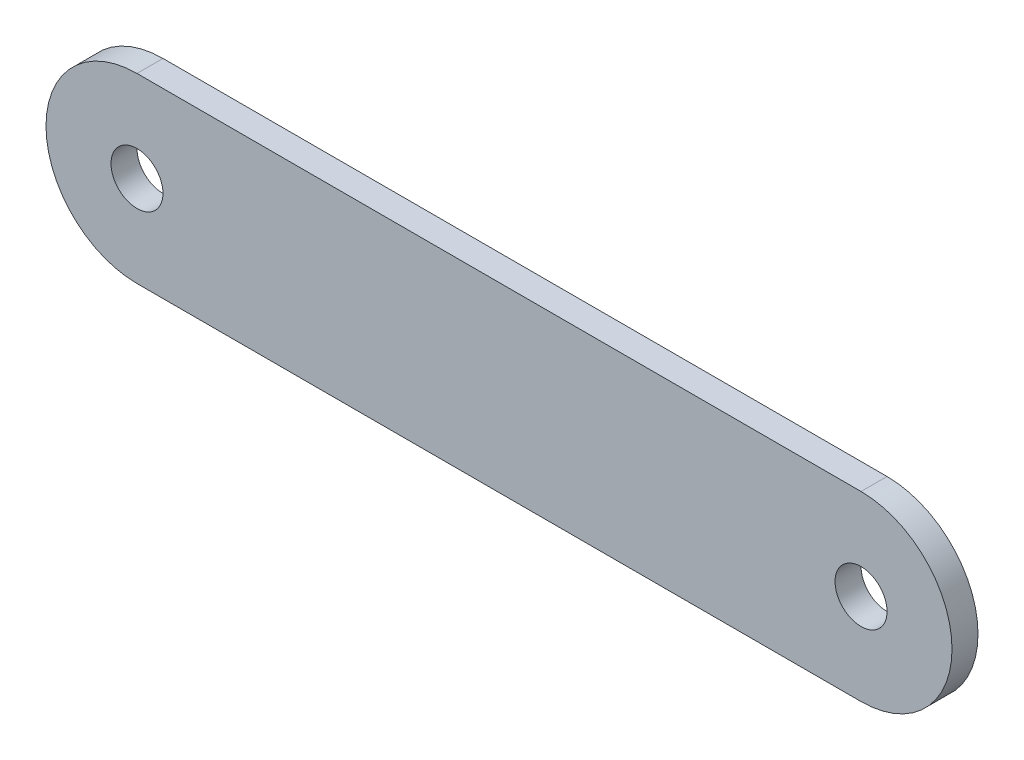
ISO-10303-21;
HEADER;
FILE_DESCRIPTION(('STEP AP214'),'2;1');
FILE_NAME('part.step','',(''),(''),'','','');
FILE_SCHEMA(('AUTOMOTIVE_DESIGN { 1 0 10303 214 1 1 1 1 }'));
ENDSEC;
DATA;
#1=APPLICATION_CONTEXT('core data for automotive mechanical design processes');
#2=APPLICATION_PROTOCOL_DEFINITION('international standard','automotive_design',2000,#1);
#3=PRODUCT_CONTEXT('',#1,'mechanical');
#4=PRODUCT('Part','Part','',(#3));
#5=PRODUCT_RELATED_PRODUCT_CATEGORY('part','',(#4));
#6=PRODUCT_DEFINITION_FORMATION('','',#4);
#7=PRODUCT_DEFINITION_CONTEXT('part definition',#1,'design');
#8=PRODUCT_DEFINITION('design','',#6,#7);
#9=PRODUCT_DEFINITION_SHAPE('','',#8);
#10=(LENGTH_UNIT() NAMED_UNIT(*) SI_UNIT(.MILLI.,.METRE.));
#11=(NAMED_UNIT(*) PLANE_ANGLE_UNIT() SI_UNIT($,.RADIAN.));
#12=(NAMED_UNIT(*) SI_UNIT($,.STERADIAN.) SOLID_ANGLE_UNIT());
#13=UNCERTAINTY_MEASURE_WITH_UNIT(LENGTH_MEASURE(1.E-05),#10,'distance_accuracy_value','');
#14=(GEOMETRIC_REPRESENTATION_CONTEXT(3) GLOBAL_UNCERTAINTY_ASSIGNED_CONTEXT((#13)) GLOBAL_UNIT_ASSIGNED_CONTEXT((#10,
#11,#12)) REPRESENTATION_CONTEXT('',''));
#15=CARTESIAN_POINT('',(0.,0.,0.));
#16=DIRECTION('',(0.,0.,1.));
#17=DIRECTION('',(1.,0.,0.));
#18=AXIS2_PLACEMENT_3D('',#15,#16,#17);
#19=CARTESIAN_POINT('',(0.,0.,50.8));
#20=DIRECTION('',(0.,0.,1.));
#21=DIRECTION('',(1.,0.,0.));
#22=AXIS2_PLACEMENT_3D('',#19,#20,#21);
#23=PLANE('',#22);
#24=CARTESIAN_POINT('',(0.,0.,50.8));
#25=DIRECTION('',(0.,0.,1.));
#26=DIRECTION('',(1.,0.,0.));
#27=AXIS2_PLACEMENT_3D('',#24,#25,#26);
#28=CIRCLE('',#27,50.8);
#29=CARTESIAN_POINT('',(50.8,0.,50.8));
#30=VERTEX_POINT('',#29);
#31=EDGE_CURVE('E99',#30,#30,#28,.T.);
#32=ORIENTED_EDGE('',*,*,#31,.F.);
#33=EDGE_LOOP('',(#32));
#34=FACE_BOUND('',#33,.T.);
#35=CARTESIAN_POINT('',(0.,0.,50.8));
#36=DIRECTION('',(0.,0.,1.));
#37=DIRECTION('',(1.,0.,0.));
#38=AXIS2_PLACEMENT_3D('',#35,#36,#37);
#39=CIRCLE('',#38,177.8);
#40=CARTESIAN_POINT('',(0.,177.8,50.8));
#41=VERTEX_POINT('',#40);
#42=CARTESIAN_POINT('',(0.,-177.8,50.8));
#43=VERTEX_POINT('',#42);
#44=EDGE_CURVE('E84',#41,#43,#39,.T.);
#45=ORIENTED_EDGE('',*,*,#44,.T.);
#46=DIRECTION('',(1.,0.,0.));
#47=VECTOR('',#46,1.);
#48=CARTESIAN_POINT('',(0.,-177.8,50.8));
#49=LINE('',#48,#47);
#50=CARTESIAN_POINT('',(1415.,-177.8,50.8));
#51=VERTEX_POINT('',#50);
#52=EDGE_CURVE('E79',#43,#51,#49,.T.);
#53=ORIENTED_EDGE('',*,*,#52,.T.);
#54=CARTESIAN_POINT('',(1415.,0.,50.8));
#55=DIRECTION('',(0.,0.,1.));
#56=DIRECTION('',(1.,0.,0.));
#57=AXIS2_PLACEMENT_3D('',#54,#55,#56);
#58=CIRCLE('',#57,177.8);
#59=CARTESIAN_POINT('',(1415.,177.8,50.8));
#60=VERTEX_POINT('',#59);
#61=EDGE_CURVE('E82',#51,#60,#58,.T.);
#62=ORIENTED_EDGE('',*,*,#61,.T.);
#63=DIRECTION('',(-1.,0.,0.));
#64=VECTOR('',#63,1.);
#65=CARTESIAN_POINT('',(0.,177.8,50.8));
#66=LINE('',#65,#64);
#67=EDGE_CURVE('E49',#60,#41,#66,.T.);
#68=ORIENTED_EDGE('',*,*,#67,.T.);
#69=EDGE_LOOP('',(#45,#53,#62,#68));
#70=FACE_BOUND('',#69,.T.);
#71=CARTESIAN_POINT('',(1415.,0.,50.8));
#72=DIRECTION('',(0.,0.,1.));
#73=DIRECTION('',(1.,0.,0.));
#74=AXIS2_PLACEMENT_3D('',#71,#72,#73);
#75=CIRCLE('',#74,50.8);
#76=CARTESIAN_POINT('',(1465.8,0.,50.8));
#77=VERTEX_POINT('',#76);
#78=EDGE_CURVE('E114',#77,#77,#75,.T.);
#79=ORIENTED_EDGE('',*,*,#78,.F.);
#80=EDGE_LOOP('',(#79));
#81=FACE_BOUND('',#80,.T.);
#82=ADVANCED_FACE('F32',(#34,#70,#81),#23,.T.);
#83=CARTESIAN_POINT('',(0.,0.,0.));
#84=DIRECTION('',(0.,0.,1.));
#85=DIRECTION('',(1.,0.,0.));
#86=AXIS2_PLACEMENT_3D('',#83,#84,#85);
#87=PLANE('',#86);
#88=CARTESIAN_POINT('',(0.,0.,0.));
#89=DIRECTION('',(0.,0.,1.));
#90=DIRECTION('',(1.,0.,0.));
#91=AXIS2_PLACEMENT_3D('',#88,#89,#90);
#92=CIRCLE('',#91,50.8);
#93=CARTESIAN_POINT('',(50.8,0.,0.));
#94=VERTEX_POINT('',#93);
#95=EDGE_CURVE('E111',#94,#94,#92,.T.);
#96=ORIENTED_EDGE('',*,*,#95,.T.);
#97=EDGE_LOOP('',(#96));
#98=FACE_BOUND('',#97,.T.);
#99=CARTESIAN_POINT('',(0.,0.,0.));
#100=DIRECTION('',(0.,0.,1.));
#101=DIRECTION('',(1.,0.,0.));
#102=AXIS2_PLACEMENT_3D('',#99,#100,#101);
#103=CIRCLE('',#102,177.8);
#104=CARTESIAN_POINT('',(0.,177.8,0.));
#105=VERTEX_POINT('',#104);
#106=CARTESIAN_POINT('',(0.,-177.8,0.));
#107=VERTEX_POINT('',#106);
#108=EDGE_CURVE('E96',#105,#107,#103,.T.);
#109=ORIENTED_EDGE('',*,*,#108,.F.);
#110=DIRECTION('',(-1.,0.,0.));
#111=VECTOR('',#110,1.);
#112=CARTESIAN_POINT('',(0.,177.8,0.));
#113=LINE('',#112,#111);
#114=CARTESIAN_POINT('',(1415.,177.8,0.));
#115=VERTEX_POINT('',#114);
#116=EDGE_CURVE('E72',#115,#105,#113,.T.);
#117=ORIENTED_EDGE('',*,*,#116,.F.);
#118=CARTESIAN_POINT('',(1415.,0.,0.));
#119=DIRECTION('',(0.,0.,1.));
#120=DIRECTION('',(1.,0.,0.));
#121=AXIS2_PLACEMENT_3D('',#118,#119,#120);
#122=CIRCLE('',#121,177.8);
#123=CARTESIAN_POINT('',(1415.,-177.8,0.));
#124=VERTEX_POINT('',#123);
#125=EDGE_CURVE('E66',#124,#115,#122,.T.);
#126=ORIENTED_EDGE('',*,*,#125,.F.);
#127=DIRECTION('',(1.,0.,0.));
#128=VECTOR('',#127,1.);
#129=CARTESIAN_POINT('',(0.,-177.8,0.));
#130=LINE('',#129,#128);
#131=EDGE_CURVE('E88',#107,#124,#130,.T.);
#132=ORIENTED_EDGE('',*,*,#131,.F.);
#133=EDGE_LOOP('',(#109,#117,#126,#132));
#134=FACE_BOUND('',#133,.T.);
#135=CARTESIAN_POINT('',(1415.,0.,0.));
#136=DIRECTION('',(0.,0.,1.));
#137=DIRECTION('',(1.,0.,0.));
#138=AXIS2_PLACEMENT_3D('',#135,#136,#137);
#139=CIRCLE('',#138,50.8);
#140=CARTESIAN_POINT('',(1465.8,0.,0.));
#141=VERTEX_POINT('',#140);
#142=EDGE_CURVE('E117',#141,#141,#139,.T.);
#143=ORIENTED_EDGE('',*,*,#142,.T.);
#144=EDGE_LOOP('',(#143));
#145=FACE_BOUND('',#144,.T.);
#146=ADVANCED_FACE('F107',(#98,#134,#145),#87,.F.);
#147=CARTESIAN_POINT('',(0.,0.,50.8));
#148=DIRECTION('',(0.,0.,-1.));
#149=DIRECTION('',(-1.,0.,0.));
#150=AXIS2_PLACEMENT_3D('',#147,#148,#149);
#151=CYLINDRICAL_SURFACE('',#150,177.8);
#152=ORIENTED_EDGE('',*,*,#108,.T.);
#153=DIRECTION('',(0.,0.,-1.));
#154=VECTOR('',#153,1.);
#155=CARTESIAN_POINT('',(0.,-177.8,50.8));
#156=LINE('',#155,#154);
#157=EDGE_CURVE('E11',#43,#107,#156,.T.);
#158=ORIENTED_EDGE('',*,*,#157,.F.);
#159=ORIENTED_EDGE('',*,*,#44,.F.);
#160=DIRECTION('',(0.,0.,-1.));
#161=VECTOR('',#160,1.);
#162=CARTESIAN_POINT('',(0.,177.8,50.8));
#163=LINE('',#162,#161);
#164=EDGE_CURVE('E92',#41,#105,#163,.T.);
#165=ORIENTED_EDGE('',*,*,#164,.T.);
#166=EDGE_LOOP('',(#152,#158,#159,#165));
#167=FACE_BOUND('',#166,.T.);
#168=ADVANCED_FACE('F34',(#167),#151,.T.);
#169=CARTESIAN_POINT('',(0.,-177.8,50.8));
#170=DIRECTION('',(0.,1.,0.));
#171=DIRECTION('',(0.,0.,1.));
#172=AXIS2_PLACEMENT_3D('',#169,#170,#171);
#173=PLANE('',#172);
#174=ORIENTED_EDGE('',*,*,#131,.T.);
#175=DIRECTION('',(0.,0.,-1.));
#176=VECTOR('',#175,1.);
#177=CARTESIAN_POINT('',(1415.,-177.8,50.8));
#178=LINE('',#177,#176);
#179=EDGE_CURVE('E41',#51,#124,#178,.T.);
#180=ORIENTED_EDGE('',*,*,#179,.F.);
#181=ORIENTED_EDGE('',*,*,#52,.F.);
#182=ORIENTED_EDGE('',*,*,#157,.T.);
#183=EDGE_LOOP('',(#174,#180,#181,#182));
#184=FACE_BOUND('',#183,.T.);
#185=ADVANCED_FACE('F87',(#184),#173,.F.);
#186=CARTESIAN_POINT('',(1415.,0.,50.8));
#187=DIRECTION('',(0.,0.,-1.));
#188=DIRECTION('',(-1.,0.,0.));
#189=AXIS2_PLACEMENT_3D('',#186,#187,#188);
#190=CYLINDRICAL_SURFACE('',#189,177.8);
#191=ORIENTED_EDGE('',*,*,#125,.T.);
#192=DIRECTION('',(0.,0.,-1.));
#193=VECTOR('',#192,1.);
#194=CARTESIAN_POINT('',(1415.,177.8,50.8));
#195=LINE('',#194,#193);
#196=EDGE_CURVE('E89',#60,#115,#195,.T.);
#197=ORIENTED_EDGE('',*,*,#196,.F.);
#198=ORIENTED_EDGE('',*,*,#61,.F.);
#199=ORIENTED_EDGE('',*,*,#179,.T.);
#200=EDGE_LOOP('',(#191,#197,#198,#199));
#201=FACE_BOUND('',#200,.T.);
#202=ADVANCED_FACE('F90',(#201),#190,.T.);
#203=CARTESIAN_POINT('',(0.,177.8,50.8));
#204=DIRECTION('',(0.,-1.,0.));
#205=DIRECTION('',(0.,0.,-1.));
#206=AXIS2_PLACEMENT_3D('',#203,#204,#205);
#207=PLANE('',#206);
#208=ORIENTED_EDGE('',*,*,#116,.T.);
#209=ORIENTED_EDGE('',*,*,#164,.F.);
#210=ORIENTED_EDGE('',*,*,#67,.F.);
#211=ORIENTED_EDGE('',*,*,#196,.T.);
#212=EDGE_LOOP('',(#208,#209,#210,#211));
#213=FACE_BOUND('',#212,.T.);
#214=ADVANCED_FACE('F104',(#213),#207,.F.);
#215=CARTESIAN_POINT('',(0.,0.,50.8));
#216=DIRECTION('',(0.,0.,-1.));
#217=DIRECTION('',(-1.,0.,0.));
#218=AXIS2_PLACEMENT_3D('',#215,#216,#217);
#219=CYLINDRICAL_SURFACE('',#218,50.8);
#220=ORIENTED_EDGE('',*,*,#31,.T.);
#221=EDGE_LOOP('',(#220));
#222=FACE_BOUND('',#221,.T.);
#223=ORIENTED_EDGE('',*,*,#95,.F.);
#224=EDGE_LOOP('',(#223));
#225=FACE_BOUND('',#224,.T.);
#226=ADVANCED_FACE('F135',(#222,#225),#219,.F.);
#227=CARTESIAN_POINT('',(1415.,0.,50.8));
#228=DIRECTION('',(0.,0.,-1.));
#229=DIRECTION('',(-1.,0.,0.));
#230=AXIS2_PLACEMENT_3D('',#227,#228,#229);
#231=CYLINDRICAL_SURFACE('',#230,50.8);
#232=ORIENTED_EDGE('',*,*,#78,.T.);
#233=EDGE_LOOP('',(#232));
#234=FACE_BOUND('',#233,.T.);
#235=ORIENTED_EDGE('',*,*,#142,.F.);
#236=EDGE_LOOP('',(#235));
#237=FACE_BOUND('',#236,.T.);
#238=ADVANCED_FACE('F123',(#234,#237),#231,.F.);
#239=CLOSED_SHELL('',(#82,#146,#168,#185,#202,#214,#226,#238));
#240=MANIFOLD_SOLID_BREP('B2',#239);
#241=ADVANCED_BREP_SHAPE_REPRESENTATION('',(#18,#240),#14);
#242=SHAPE_DEFINITION_REPRESENTATION(#9,#241);
ENDSEC;
END-ISO-10303-21;
